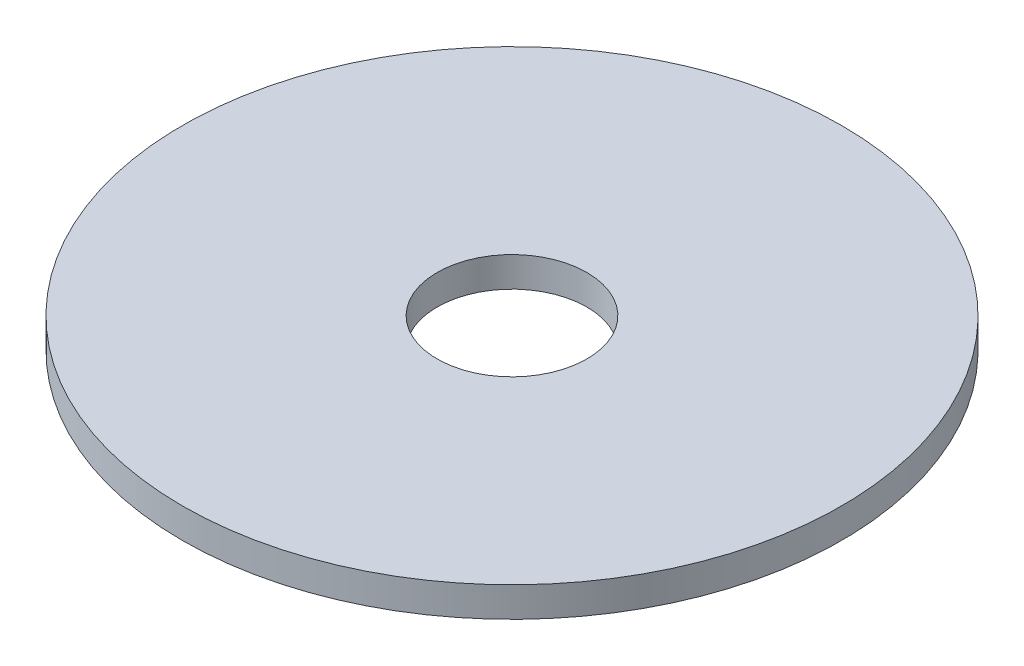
from build123d import *

# Parameters (mm, degrees)
SCHIZZO1_W = 17
SCHIZZO1_H = 2


with BuildPart() as part:
    # Schizzo1 → Rivoluzione1 (revolve)
    with BuildSketch(Plane.XY, mode=Mode.PRIVATE) as rivoluzione1_sk:
        with Locations((13.5, 26.381005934)):
            Rectangle(SCHIZZO1_W, SCHIZZO1_H)
    revolve(rivoluzione1_sk.sketch.rotate(Axis((0, 0, 0), (0, 1, 0)), 90), axis=Axis((0, 0, 0), (0, 1, 0)))


solid = part.part
